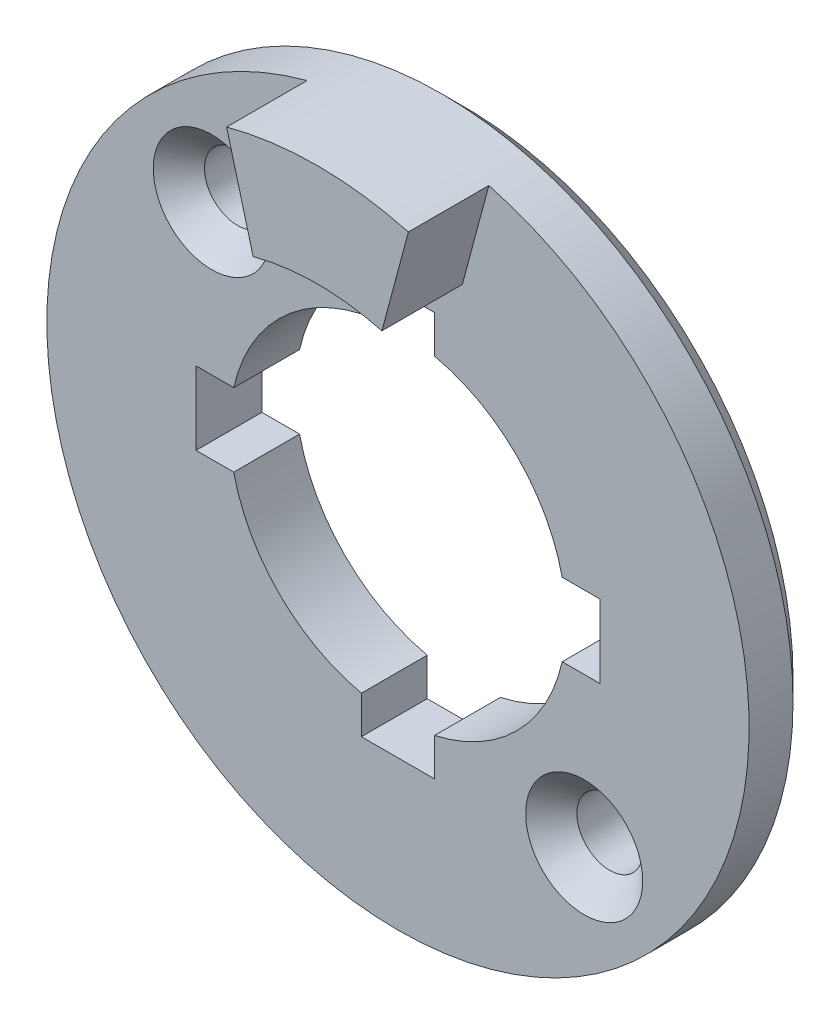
ISO-10303-21;
HEADER;
FILE_DESCRIPTION(('STEP AP214'),'2;1');
FILE_NAME('part.step','',(''),(''),'','','');
FILE_SCHEMA(('AUTOMOTIVE_DESIGN { 1 0 10303 214 1 1 1 1 }'));
ENDSEC;
DATA;
#1=APPLICATION_CONTEXT('core data for automotive mechanical design processes');
#2=APPLICATION_PROTOCOL_DEFINITION('international standard','automotive_design',2000,#1);
#3=PRODUCT_CONTEXT('',#1,'mechanical');
#4=PRODUCT('Part','Part','',(#3));
#5=PRODUCT_RELATED_PRODUCT_CATEGORY('part','',(#4));
#6=PRODUCT_DEFINITION_FORMATION('','',#4);
#7=PRODUCT_DEFINITION_CONTEXT('part definition',#1,'design');
#8=PRODUCT_DEFINITION('design','',#6,#7);
#9=PRODUCT_DEFINITION_SHAPE('','',#8);
#10=(LENGTH_UNIT() NAMED_UNIT(*) SI_UNIT(.MILLI.,.METRE.));
#11=(NAMED_UNIT(*) PLANE_ANGLE_UNIT() SI_UNIT($,.RADIAN.));
#12=(NAMED_UNIT(*) SI_UNIT($,.STERADIAN.) SOLID_ANGLE_UNIT());
#13=UNCERTAINTY_MEASURE_WITH_UNIT(LENGTH_MEASURE(1.E-05),#10,'distance_accuracy_value','');
#14=(GEOMETRIC_REPRESENTATION_CONTEXT(3) GLOBAL_UNCERTAINTY_ASSIGNED_CONTEXT((#13)) GLOBAL_UNIT_ASSIGNED_CONTEXT((#10,
#11,#12)) REPRESENTATION_CONTEXT('',''));
#15=CARTESIAN_POINT('',(0.,0.,0.));
#16=DIRECTION('',(0.,0.,1.));
#17=DIRECTION('',(1.,0.,0.));
#18=AXIS2_PLACEMENT_3D('',#15,#16,#17);
#19=CARTESIAN_POINT('',(0.,0.,4.5));
#20=DIRECTION('',(0.,0.,-1.));
#21=DIRECTION('',(-1.,0.,0.));
#22=AXIS2_PLACEMENT_3D('',#19,#20,#21);
#23=CYLINDRICAL_SURFACE('',#22,11.5);
#24=DIRECTION('',(0.,0.,-1.));
#25=VECTOR('',#24,1.);
#26=CARTESIAN_POINT('',(-11.2249721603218,2.50000000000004,10.000025));
#27=LINE('',#26,#25);
#28=CARTESIAN_POINT('',(-11.2249721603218,2.50000000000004,4.5));
#29=VERTEX_POINT('',#28);
#30=CARTESIAN_POINT('',(-11.2249721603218,2.50000000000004,0.));
#31=VERTEX_POINT('',#30);
#32=EDGE_CURVE('E198',#29,#31,#27,.T.);
#33=ORIENTED_EDGE('',*,*,#32,.T.);
#34=CARTESIAN_POINT('',(0.,0.,0.));
#35=DIRECTION('',(0.,0.,1.));
#36=DIRECTION('',(1.,0.,0.));
#37=AXIS2_PLACEMENT_3D('',#34,#35,#36);
#38=CIRCLE('',#37,11.5);
#39=CARTESIAN_POINT('',(-2.5,11.2249721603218,0.));
#40=VERTEX_POINT('',#39);
#41=EDGE_CURVE('E324',#40,#31,#38,.T.);
#42=ORIENTED_EDGE('',*,*,#41,.F.);
#43=DIRECTION('',(0.,0.,-1.));
#44=VECTOR('',#43,1.);
#45=CARTESIAN_POINT('',(-2.49999999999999,11.2249721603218,4.5));
#46=LINE('',#45,#44);
#47=CARTESIAN_POINT('',(-2.5,11.2249721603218,4.5));
#48=VERTEX_POINT('',#47);
#49=EDGE_CURVE('E303',#48,#40,#46,.T.);
#50=ORIENTED_EDGE('',*,*,#49,.F.);
#51=CARTESIAN_POINT('',(0.,0.,4.5));
#52=DIRECTION('',(0.,0.,1.));
#53=DIRECTION('',(1.,0.,0.));
#54=AXIS2_PLACEMENT_3D('',#51,#52,#53);
#55=CIRCLE('',#54,11.5);
#56=EDGE_CURVE('E335',#48,#29,#55,.T.);
#57=ORIENTED_EDGE('',*,*,#56,.T.);
#58=EDGE_LOOP('',(#33,#42,#50,#57));
#59=FACE_BOUND('',#58,.T.);
#60=ADVANCED_FACE('F36',(#59),#23,.F.);
#61=DIRECTION('',(0.,0.,-1.));
#62=VECTOR('',#61,1.);
#63=CARTESIAN_POINT('',(11.2249721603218,-2.50000000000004,4.5));
#64=LINE('',#63,#62);
#65=CARTESIAN_POINT('',(11.2249721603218,-2.50000000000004,0.));
#66=VERTEX_POINT('',#65);
#67=CARTESIAN_POINT('',(11.2249721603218,-2.50000000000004,4.5));
#68=VERTEX_POINT('',#67);
#69=EDGE_CURVE('E11',#66,#68,#64,.F.);
#70=ORIENTED_EDGE('',*,*,#69,.F.);
#71=CARTESIAN_POINT('',(2.5,-11.2249721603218,0.));
#72=VERTEX_POINT('',#71);
#73=EDGE_CURVE('E320',#72,#66,#38,.T.);
#74=ORIENTED_EDGE('',*,*,#73,.F.);
#75=DIRECTION('',(0.,0.,-1.));
#76=VECTOR('',#75,1.);
#77=CARTESIAN_POINT('',(2.5,-11.2249721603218,4.5));
#78=LINE('',#77,#76);
#79=CARTESIAN_POINT('',(2.5,-11.2249721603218,4.5));
#80=VERTEX_POINT('',#79);
#81=EDGE_CURVE('E305',#80,#72,#78,.T.);
#82=ORIENTED_EDGE('',*,*,#81,.F.);
#83=EDGE_CURVE('E332',#80,#68,#55,.T.);
#84=ORIENTED_EDGE('',*,*,#83,.T.);
#85=EDGE_LOOP('',(#70,#74,#82,#84));
#86=FACE_BOUND('',#85,.T.);
#87=ADVANCED_FACE('F382',(#86),#23,.F.);
#88=DIRECTION('',(0.,0.,-1.));
#89=VECTOR('',#88,1.);
#90=CARTESIAN_POINT('',(-11.2249721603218,-2.49999999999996,10.000025));
#91=LINE('',#90,#89);
#92=CARTESIAN_POINT('',(-11.2249721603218,-2.49999999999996,4.5));
#93=VERTEX_POINT('',#92);
#94=CARTESIAN_POINT('',(-11.2249721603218,-2.49999999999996,0.));
#95=VERTEX_POINT('',#94);
#96=EDGE_CURVE('E51',#93,#95,#91,.T.);
#97=ORIENTED_EDGE('',*,*,#96,.F.);
#98=CARTESIAN_POINT('',(-2.5,-11.2249721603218,4.5));
#99=VERTEX_POINT('',#98);
#100=EDGE_CURVE('E333',#93,#99,#55,.T.);
#101=ORIENTED_EDGE('',*,*,#100,.T.);
#102=DIRECTION('',(0.,0.,-1.));
#103=VECTOR('',#102,1.);
#104=CARTESIAN_POINT('',(-2.5,-11.2249721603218,4.5));
#105=LINE('',#104,#103);
#106=CARTESIAN_POINT('',(-2.5,-11.2249721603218,0.));
#107=VERTEX_POINT('',#106);
#108=EDGE_CURVE('E307',#107,#99,#105,.F.);
#109=ORIENTED_EDGE('',*,*,#108,.F.);
#110=EDGE_CURVE('E322',#95,#107,#38,.T.);
#111=ORIENTED_EDGE('',*,*,#110,.F.);
#112=EDGE_LOOP('',(#97,#101,#109,#111));
#113=FACE_BOUND('',#112,.T.);
#114=ADVANCED_FACE('F387',(#113),#23,.F.);
#115=CARTESIAN_POINT('',(0.,0.,4.5));
#116=DIRECTION('',(0.,0.,1.));
#117=DIRECTION('',(1.,0.,0.));
#118=AXIS2_PLACEMENT_3D('',#115,#116,#117);
#119=PLANE('',#118);
#120=CARTESIAN_POINT('',(-12.727922,12.727922,4.5));
#121=DIRECTION('',(0.,0.,1.));
#122=DIRECTION('',(1.,0.,0.));
#123=AXIS2_PLACEMENT_3D('',#120,#121,#122);
#124=CIRCLE('',#123,4.);
#125=CARTESIAN_POINT('',(-8.727922,12.727922,4.5));
#126=VERTEX_POINT('',#125);
#127=EDGE_CURVE('E496',#126,#126,#124,.T.);
#128=ORIENTED_EDGE('',*,*,#127,.F.);
#129=EDGE_LOOP('',(#128));
#130=FACE_BOUND('',#129,.T.);
#131=CARTESIAN_POINT('',(12.727922,-12.7279219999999,4.5));
#132=DIRECTION('',(0.,0.,1.));
#133=DIRECTION('',(1.,0.,0.));
#134=AXIS2_PLACEMENT_3D('',#131,#132,#133);
#135=CIRCLE('',#134,4.);
#136=CARTESIAN_POINT('',(16.727922,-12.7279219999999,4.5));
#137=VERTEX_POINT('',#136);
#138=EDGE_CURVE('E189',#137,#137,#135,.T.);
#139=ORIENTED_EDGE('',*,*,#138,.F.);
#140=EDGE_LOOP('',(#139));
#141=FACE_BOUND('',#140,.T.);
#142=DIRECTION('',(-1.,0.,0.));
#143=VECTOR('',#142,1.);
#144=CARTESIAN_POINT('',(0.,2.5,4.5));
#145=LINE('',#144,#143);
#146=CARTESIAN_POINT('',(-13.8,2.50000000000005,4.5));
#147=VERTEX_POINT('',#146);
#148=EDGE_CURVE('E206',#29,#147,#145,.T.);
#149=ORIENTED_EDGE('',*,*,#148,.F.);
#150=ORIENTED_EDGE('',*,*,#56,.F.);
#151=DIRECTION('',(0.,-1.,0.));
#152=VECTOR('',#151,1.);
#153=CARTESIAN_POINT('',(-2.5,0.,4.5));
#154=LINE('',#153,#152);
#155=CARTESIAN_POINT('',(-2.5,13.8,4.5));
#156=VERTEX_POINT('',#155);
#157=EDGE_CURVE('E256',#156,#48,#154,.T.);
#158=ORIENTED_EDGE('',*,*,#157,.F.);
#159=DIRECTION('',(-1.,0.,0.));
#160=VECTOR('',#159,1.);
#161=CARTESIAN_POINT('',(0.,13.8,4.5));
#162=LINE('',#161,#160);
#163=CARTESIAN_POINT('',(2.5,13.8,4.5));
#164=VERTEX_POINT('',#163);
#165=EDGE_CURVE('E261',#164,#156,#162,.T.);
#166=ORIENTED_EDGE('',*,*,#165,.F.);
#167=DIRECTION('',(0.,1.,0.));
#168=VECTOR('',#167,1.);
#169=CARTESIAN_POINT('',(2.5,0.,4.5));
#170=LINE('',#169,#168);
#171=CARTESIAN_POINT('',(2.5,11.2249721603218,4.5));
#172=VERTEX_POINT('',#171);
#173=EDGE_CURVE('E259',#172,#164,#170,.T.);
#174=ORIENTED_EDGE('',*,*,#173,.F.);
#175=CARTESIAN_POINT('',(11.2249721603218,2.49999999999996,4.5));
#176=VERTEX_POINT('',#175);
#177=EDGE_CURVE('E329',#176,#172,#55,.T.);
#178=ORIENTED_EDGE('',*,*,#177,.F.);
#179=DIRECTION('',(-1.,0.,0.));
#180=VECTOR('',#179,1.);
#181=CARTESIAN_POINT('',(0.,2.5,4.5));
#182=LINE('',#181,#180);
#183=CARTESIAN_POINT('',(13.8,2.49999999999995,4.5));
#184=VERTEX_POINT('',#183);
#185=EDGE_CURVE('E59',#184,#176,#182,.T.);
#186=ORIENTED_EDGE('',*,*,#185,.F.);
#187=DIRECTION('',(0.,1.,0.));
#188=VECTOR('',#187,1.);
#189=CARTESIAN_POINT('',(13.8,0.,4.5));
#190=LINE('',#189,#188);
#191=CARTESIAN_POINT('',(13.8,-2.50000000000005,4.5));
#192=VERTEX_POINT('',#191);
#193=EDGE_CURVE('E223',#192,#184,#190,.T.);
#194=ORIENTED_EDGE('',*,*,#193,.F.);
#195=DIRECTION('',(1.,0.,0.));
#196=VECTOR('',#195,1.);
#197=CARTESIAN_POINT('',(0.,-2.5,4.5));
#198=LINE('',#197,#196);
#199=EDGE_CURVE('E221',#68,#192,#198,.T.);
#200=ORIENTED_EDGE('',*,*,#199,.F.);
#201=ORIENTED_EDGE('',*,*,#83,.F.);
#202=DIRECTION('',(0.,1.,0.));
#203=VECTOR('',#202,1.);
#204=CARTESIAN_POINT('',(2.5,0.,4.5));
#205=LINE('',#204,#203);
#206=CARTESIAN_POINT('',(2.5,-13.8,4.5));
#207=VERTEX_POINT('',#206);
#208=EDGE_CURVE('E237',#207,#80,#205,.T.);
#209=ORIENTED_EDGE('',*,*,#208,.F.);
#210=DIRECTION('',(1.,0.,0.));
#211=VECTOR('',#210,1.);
#212=CARTESIAN_POINT('',(0.,-13.8,4.5));
#213=LINE('',#212,#211);
#214=CARTESIAN_POINT('',(-2.5,-13.8,4.5));
#215=VERTEX_POINT('',#214);
#216=EDGE_CURVE('E242',#215,#207,#213,.T.);
#217=ORIENTED_EDGE('',*,*,#216,.F.);
#218=DIRECTION('',(0.,-1.,0.));
#219=VECTOR('',#218,1.);
#220=CARTESIAN_POINT('',(-2.5,0.,4.5));
#221=LINE('',#220,#219);
#222=EDGE_CURVE('E240',#99,#215,#221,.T.);
#223=ORIENTED_EDGE('',*,*,#222,.F.);
#224=ORIENTED_EDGE('',*,*,#100,.F.);
#225=DIRECTION('',(1.,0.,0.));
#226=VECTOR('',#225,1.);
#227=CARTESIAN_POINT('',(0.,-2.5,4.5));
#228=LINE('',#227,#226);
#229=CARTESIAN_POINT('',(-13.8,-2.49999999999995,4.5));
#230=VERTEX_POINT('',#229);
#231=EDGE_CURVE('E201',#230,#93,#228,.T.);
#232=ORIENTED_EDGE('',*,*,#231,.F.);
#233=DIRECTION('',(0.,-1.,0.));
#234=VECTOR('',#233,1.);
#235=CARTESIAN_POINT('',(-13.8,0.,4.5));
#236=LINE('',#235,#234);
#237=EDGE_CURVE('E181',#147,#230,#236,.T.);
#238=ORIENTED_EDGE('',*,*,#237,.F.);
#239=EDGE_LOOP('',(#149,#150,#158,#166,#174,#178,#186,#194,#200,#201,#209,#217,#223,#224,#232,#238));
#240=FACE_BOUND('',#239,.T.);
#241=DIRECTION('',(0.258819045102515,-0.96592582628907,0.));
#242=VECTOR('',#241,1.);
#243=CARTESIAN_POINT('',(-6.21165708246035,23.1822198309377,4.5));
#244=LINE('',#243,#242);
#245=CARTESIAN_POINT('',(-6.21165708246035,23.1822198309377,4.5));
#246=VERTEX_POINT('',#245);
#247=CARTESIAN_POINT('',(-4.39992376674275,16.4207390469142,4.5));
#248=VERTEX_POINT('',#247);
#249=EDGE_CURVE('E275',#246,#248,#244,.T.);
#250=ORIENTED_EDGE('',*,*,#249,.F.);
#251=CARTESIAN_POINT('',(0.,0.,4.5));
#252=DIRECTION('',(0.,0.,1.));
#253=DIRECTION('',(1.,0.,0.));
#254=AXIS2_PLACEMENT_3D('',#251,#252,#253);
#255=CIRCLE('',#254,24.);
#256=CARTESIAN_POINT('',(6.21165708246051,23.1822198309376,4.5));
#257=VERTEX_POINT('',#256);
#258=EDGE_CURVE('E276',#246,#257,#255,.T.);
#259=ORIENTED_EDGE('',*,*,#258,.T.);
#260=DIRECTION('',(0.258819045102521,0.965925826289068,0.));
#261=VECTOR('',#260,1.);
#262=CARTESIAN_POINT('',(4.39992376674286,16.4207390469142,4.5));
#263=LINE('',#262,#261);
#264=CARTESIAN_POINT('',(4.39992376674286,16.4207390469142,4.5));
#265=VERTEX_POINT('',#264);
#266=EDGE_CURVE('E266',#265,#257,#263,.T.);
#267=ORIENTED_EDGE('',*,*,#266,.F.);
#268=CARTESIAN_POINT('',(0.,0.,4.5));
#269=DIRECTION('',(0.,0.,-1.));
#270=DIRECTION('',(1.,0.,0.));
#271=AXIS2_PLACEMENT_3D('',#268,#269,#270);
#272=CIRCLE('',#271,17.);
#273=EDGE_CURVE('E263',#248,#265,#272,.T.);
#274=ORIENTED_EDGE('',*,*,#273,.F.);
#275=EDGE_LOOP('',(#250,#259,#267,#274));
#276=FACE_BOUND('',#275,.T.);
#277=ADVANCED_FACE('F345',(#130,#141,#240,#276),#119,.T.);
#278=CARTESIAN_POINT('',(0.,0.,0.));
#279=DIRECTION('',(0.,0.,1.));
#280=DIRECTION('',(1.,0.,0.));
#281=AXIS2_PLACEMENT_3D('',#278,#279,#280);
#282=PLANE('',#281);
#283=CARTESIAN_POINT('',(-12.727922,12.727922,0.));
#284=DIRECTION('',(0.,0.,1.));
#285=DIRECTION('',(1.,0.,0.));
#286=AXIS2_PLACEMENT_3D('',#283,#284,#285);
#287=CIRCLE('',#286,2.24999999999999);
#288=CARTESIAN_POINT('',(-10.477922,12.727922,0.));
#289=VERTEX_POINT('',#288);
#290=EDGE_CURVE('E502',#289,#289,#287,.T.);
#291=ORIENTED_EDGE('',*,*,#290,.T.);
#292=EDGE_LOOP('',(#291));
#293=FACE_BOUND('',#292,.T.);
#294=CARTESIAN_POINT('',(12.727922,-12.7279219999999,0.));
#295=DIRECTION('',(0.,0.,1.));
#296=DIRECTION('',(1.,0.,0.));
#297=AXIS2_PLACEMENT_3D('',#294,#295,#296);
#298=CIRCLE('',#297,2.24999999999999);
#299=CARTESIAN_POINT('',(14.977922,-12.7279219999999,0.));
#300=VERTEX_POINT('',#299);
#301=EDGE_CURVE('E491',#300,#300,#298,.T.);
#302=ORIENTED_EDGE('',*,*,#301,.T.);
#303=EDGE_LOOP('',(#302));
#304=FACE_BOUND('',#303,.T.);
#305=CARTESIAN_POINT('',(0.,0.,0.));
#306=DIRECTION('',(0.,0.,1.));
#307=DIRECTION('',(1.,0.,0.));
#308=AXIS2_PLACEMENT_3D('',#305,#306,#307);
#309=CIRCLE('',#308,22.5);
#310=CARTESIAN_POINT('',(22.5,0.,0.));
#311=VERTEX_POINT('',#310);
#312=EDGE_CURVE('E297',#311,#311,#309,.F.);
#313=ORIENTED_EDGE('',*,*,#312,.T.);
#314=EDGE_LOOP('',(#313));
#315=FACE_BOUND('',#314,.T.);
#316=ORIENTED_EDGE('',*,*,#41,.T.);
#317=DIRECTION('',(1.,0.,0.));
#318=VECTOR('',#317,1.);
#319=CARTESIAN_POINT('',(-11.2249721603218,2.50000000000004,0.));
#320=LINE('',#319,#318);
#321=CARTESIAN_POINT('',(-13.8,2.50000000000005,0.));
#322=VERTEX_POINT('',#321);
#323=EDGE_CURVE('E193',#322,#31,#320,.T.);
#324=ORIENTED_EDGE('',*,*,#323,.F.);
#325=DIRECTION('',(0.,1.,0.));
#326=VECTOR('',#325,1.);
#327=CARTESIAN_POINT('',(-13.8,-2.49999999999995,0.));
#328=LINE('',#327,#326);
#329=CARTESIAN_POINT('',(-13.8,-2.49999999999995,0.));
#330=VERTEX_POINT('',#329);
#331=EDGE_CURVE('E178',#330,#322,#328,.T.);
#332=ORIENTED_EDGE('',*,*,#331,.F.);
#333=DIRECTION('',(-1.,0.,0.));
#334=VECTOR('',#333,1.);
#335=CARTESIAN_POINT('',(-11.2249721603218,-2.49999999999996,0.));
#336=LINE('',#335,#334);
#337=EDGE_CURVE('E185',#95,#330,#336,.T.);
#338=ORIENTED_EDGE('',*,*,#337,.F.);
#339=ORIENTED_EDGE('',*,*,#110,.T.);
#340=DIRECTION('',(0.,1.,0.));
#341=VECTOR('',#340,1.);
#342=CARTESIAN_POINT('',(-2.5,-11.2249721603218,0.));
#343=LINE('',#342,#341);
#344=CARTESIAN_POINT('',(-2.5,-13.8,0.));
#345=VERTEX_POINT('',#344);
#346=EDGE_CURVE('E231',#345,#107,#343,.T.);
#347=ORIENTED_EDGE('',*,*,#346,.F.);
#348=DIRECTION('',(-1.,0.,0.));
#349=VECTOR('',#348,1.);
#350=CARTESIAN_POINT('',(2.5,-13.8,0.));
#351=LINE('',#350,#349);
#352=CARTESIAN_POINT('',(2.5,-13.8,0.));
#353=VERTEX_POINT('',#352);
#354=EDGE_CURVE('E228',#353,#345,#351,.T.);
#355=ORIENTED_EDGE('',*,*,#354,.F.);
#356=DIRECTION('',(0.,-1.,0.));
#357=VECTOR('',#356,1.);
#358=CARTESIAN_POINT('',(2.5,-11.2249721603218,0.));
#359=LINE('',#358,#357);
#360=EDGE_CURVE('E225',#72,#353,#359,.T.);
#361=ORIENTED_EDGE('',*,*,#360,.F.);
#362=ORIENTED_EDGE('',*,*,#73,.T.);
#363=DIRECTION('',(-1.,0.,0.));
#364=VECTOR('',#363,1.);
#365=CARTESIAN_POINT('',(11.2249721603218,-2.50000000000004,0.));
#366=LINE('',#365,#364);
#367=CARTESIAN_POINT('',(13.8,-2.50000000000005,0.));
#368=VERTEX_POINT('',#367);
#369=EDGE_CURVE('E214',#368,#66,#366,.T.);
#370=ORIENTED_EDGE('',*,*,#369,.F.);
#371=DIRECTION('',(0.,-1.,0.));
#372=VECTOR('',#371,1.);
#373=CARTESIAN_POINT('',(13.8,-2.50000000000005,0.));
#374=LINE('',#373,#372);
#375=CARTESIAN_POINT('',(13.8,2.49999999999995,0.));
#376=VERTEX_POINT('',#375);
#377=EDGE_CURVE('E211',#376,#368,#374,.T.);
#378=ORIENTED_EDGE('',*,*,#377,.F.);
#379=DIRECTION('',(1.,0.,0.));
#380=VECTOR('',#379,1.);
#381=CARTESIAN_POINT('',(11.2249721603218,2.49999999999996,0.));
#382=LINE('',#381,#380);
#383=CARTESIAN_POINT('',(11.2249721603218,2.49999999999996,0.));
#384=VERTEX_POINT('',#383);
#385=EDGE_CURVE('E208',#384,#376,#382,.T.);
#386=ORIENTED_EDGE('',*,*,#385,.F.);
#387=CARTESIAN_POINT('',(2.49999999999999,11.2249721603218,0.));
#388=VERTEX_POINT('',#387);
#389=EDGE_CURVE('E316',#384,#388,#38,.T.);
#390=ORIENTED_EDGE('',*,*,#389,.T.);
#391=DIRECTION('',(0.,-1.,0.));
#392=VECTOR('',#391,1.);
#393=CARTESIAN_POINT('',(2.5,11.2249721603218,0.));
#394=LINE('',#393,#392);
#395=CARTESIAN_POINT('',(2.5,13.8,0.));
#396=VERTEX_POINT('',#395);
#397=EDGE_CURVE('E244',#396,#388,#394,.T.);
#398=ORIENTED_EDGE('',*,*,#397,.F.);
#399=DIRECTION('',(1.,0.,0.));
#400=VECTOR('',#399,1.);
#401=CARTESIAN_POINT('',(2.5,13.8,0.));
#402=LINE('',#401,#400);
#403=CARTESIAN_POINT('',(-2.5,13.8,0.));
#404=VERTEX_POINT('',#403);
#405=EDGE_CURVE('E250',#404,#396,#402,.T.);
#406=ORIENTED_EDGE('',*,*,#405,.F.);
#407=DIRECTION('',(0.,1.,0.));
#408=VECTOR('',#407,1.);
#409=CARTESIAN_POINT('',(-2.5,11.2249721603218,0.));
#410=LINE('',#409,#408);
#411=EDGE_CURVE('E247',#40,#404,#410,.T.);
#412=ORIENTED_EDGE('',*,*,#411,.F.);
#413=EDGE_LOOP('',(#316,#324,#332,#338,#339,#347,#355,#361,#362,#370,#378,#386,#390,#398,#406,#412));
#414=FACE_BOUND('',#413,.T.);
#415=ADVANCED_FACE('F192',(#293,#304,#315,#414),#282,.F.);
#416=CARTESIAN_POINT('',(0.,0.,4.5));
#417=DIRECTION('',(0.,0.,-1.));
#418=DIRECTION('',(-1.,0.,0.));
#419=AXIS2_PLACEMENT_3D('',#416,#417,#418);
#420=CYLINDRICAL_SURFACE('',#419,24.);
#421=CARTESIAN_POINT('',(0.,0.,1.5));
#422=DIRECTION('',(0.,0.,1.));
#423=DIRECTION('',(1.,0.,0.));
#424=AXIS2_PLACEMENT_3D('',#421,#422,#423);
#425=CIRCLE('',#424,24.);
#426=CARTESIAN_POINT('',(24.,0.,1.5));
#427=VERTEX_POINT('',#426);
#428=EDGE_CURVE('E294',#427,#427,#425,.T.);
#429=ORIENTED_EDGE('',*,*,#428,.T.);
#430=EDGE_LOOP('',(#429));
#431=FACE_BOUND('',#430,.T.);
#432=ORIENTED_EDGE('',*,*,#258,.F.);
#433=DIRECTION('',(0.,0.,-1.));
#434=VECTOR('',#433,1.);
#435=CARTESIAN_POINT('',(-6.21165708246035,23.1822198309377,10.));
#436=LINE('',#435,#434);
#437=CARTESIAN_POINT('',(-6.21165708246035,23.1822198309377,10.));
#438=VERTEX_POINT('',#437);
#439=EDGE_CURVE('E282',#438,#246,#436,.T.);
#440=ORIENTED_EDGE('',*,*,#439,.F.);
#441=CARTESIAN_POINT('',(0.,0.,10.));
#442=DIRECTION('',(0.,0.,1.));
#443=DIRECTION('',(1.,0.,0.));
#444=AXIS2_PLACEMENT_3D('',#441,#442,#443);
#445=CIRCLE('',#444,24.);
#446=CARTESIAN_POINT('',(6.21165708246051,23.1822198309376,10.));
#447=VERTEX_POINT('',#446);
#448=EDGE_CURVE('E353',#447,#438,#445,.T.);
#449=ORIENTED_EDGE('',*,*,#448,.F.);
#450=DIRECTION('',(0.,0.,-1.));
#451=VECTOR('',#450,1.);
#452=CARTESIAN_POINT('',(6.21165708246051,23.1822198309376,10.));
#453=LINE('',#452,#451);
#454=EDGE_CURVE('E278',#447,#257,#453,.T.);
#455=ORIENTED_EDGE('',*,*,#454,.T.);
#456=EDGE_LOOP('',(#432,#440,#449,#455));
#457=FACE_BOUND('',#456,.T.);
#458=ADVANCED_FACE('F38',(#431,#457),#420,.T.);
#459=DIRECTION('',(0.,0.,-1.));
#460=VECTOR('',#459,1.);
#461=CARTESIAN_POINT('',(11.2249721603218,2.49999999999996,4.5));
#462=LINE('',#461,#460);
#463=EDGE_CURVE('E44',#176,#384,#462,.T.);
#464=ORIENTED_EDGE('',*,*,#463,.F.);
#465=ORIENTED_EDGE('',*,*,#177,.T.);
#466=DIRECTION('',(0.,0.,-1.));
#467=VECTOR('',#466,1.);
#468=CARTESIAN_POINT('',(2.49999999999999,11.2249721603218,4.5));
#469=LINE('',#468,#467);
#470=EDGE_CURVE('E300',#388,#172,#469,.F.);
#471=ORIENTED_EDGE('',*,*,#470,.F.);
#472=ORIENTED_EDGE('',*,*,#389,.F.);
#473=EDGE_LOOP('',(#464,#465,#471,#472));
#474=FACE_BOUND('',#473,.T.);
#475=ADVANCED_FACE('F319',(#474),#23,.F.);
#476=CARTESIAN_POINT('',(0.,0.,10.));
#477=DIRECTION('',(0.,0.,-1.));
#478=DIRECTION('',(-1.,0.,0.));
#479=AXIS2_PLACEMENT_3D('',#476,#477,#478);
#480=CYLINDRICAL_SURFACE('',#479,17.);
#481=ORIENTED_EDGE('',*,*,#273,.T.);
#482=DIRECTION('',(0.,0.,-1.));
#483=VECTOR('',#482,1.);
#484=CARTESIAN_POINT('',(4.39992376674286,16.4207390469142,10.));
#485=LINE('',#484,#483);
#486=CARTESIAN_POINT('',(4.39992376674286,16.4207390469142,10.));
#487=VERTEX_POINT('',#486);
#488=EDGE_CURVE('E281',#487,#265,#485,.T.);
#489=ORIENTED_EDGE('',*,*,#488,.F.);
#490=CARTESIAN_POINT('',(0.,0.,10.));
#491=DIRECTION('',(0.,0.,-1.));
#492=DIRECTION('',(1.,0.,0.));
#493=AXIS2_PLACEMENT_3D('',#490,#491,#492);
#494=CIRCLE('',#493,17.);
#495=CARTESIAN_POINT('',(-4.39992376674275,16.4207390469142,10.));
#496=VERTEX_POINT('',#495);
#497=EDGE_CURVE('E269',#496,#487,#494,.T.);
#498=ORIENTED_EDGE('',*,*,#497,.F.);
#499=DIRECTION('',(0.,0.,-1.));
#500=VECTOR('',#499,1.);
#501=CARTESIAN_POINT('',(-4.39992376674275,16.4207390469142,10.));
#502=LINE('',#501,#500);
#503=EDGE_CURVE('E291',#496,#248,#502,.T.);
#504=ORIENTED_EDGE('',*,*,#503,.T.);
#505=EDGE_LOOP('',(#481,#489,#498,#504));
#506=FACE_BOUND('',#505,.T.);
#507=ADVANCED_FACE('F365',(#506),#480,.F.);
#508=CARTESIAN_POINT('',(4.39992376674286,16.4207390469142,10.));
#509=DIRECTION('',(-0.965925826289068,0.258819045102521,0.));
#510=DIRECTION('',(-0.258819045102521,-0.965925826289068,0.));
#511=AXIS2_PLACEMENT_3D('',#508,#509,#510);
#512=PLANE('',#511);
#513=ORIENTED_EDGE('',*,*,#266,.T.);
#514=ORIENTED_EDGE('',*,*,#454,.F.);
#515=DIRECTION('',(0.258819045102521,0.965925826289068,0.));
#516=VECTOR('',#515,1.);
#517=CARTESIAN_POINT('',(4.39992376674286,16.4207390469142,10.));
#518=LINE('',#517,#516);
#519=EDGE_CURVE('E357',#487,#447,#518,.T.);
#520=ORIENTED_EDGE('',*,*,#519,.F.);
#521=ORIENTED_EDGE('',*,*,#488,.T.);
#522=EDGE_LOOP('',(#513,#514,#520,#521));
#523=FACE_BOUND('',#522,.T.);
#524=ADVANCED_FACE('F350',(#523),#512,.F.);
#525=CARTESIAN_POINT('',(-6.21165708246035,23.1822198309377,10.));
#526=DIRECTION('',(0.96592582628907,0.258819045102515,0.));
#527=DIRECTION('',(-0.258819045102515,0.96592582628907,0.));
#528=AXIS2_PLACEMENT_3D('',#525,#526,#527);
#529=PLANE('',#528);
#530=ORIENTED_EDGE('',*,*,#249,.T.);
#531=ORIENTED_EDGE('',*,*,#503,.F.);
#532=DIRECTION('',(0.258819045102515,-0.96592582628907,0.));
#533=VECTOR('',#532,1.);
#534=CARTESIAN_POINT('',(-6.21165708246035,23.1822198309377,10.));
#535=LINE('',#534,#533);
#536=EDGE_CURVE('E356',#438,#496,#535,.T.);
#537=ORIENTED_EDGE('',*,*,#536,.F.);
#538=ORIENTED_EDGE('',*,*,#439,.T.);
#539=EDGE_LOOP('',(#530,#531,#537,#538));
#540=FACE_BOUND('',#539,.T.);
#541=ADVANCED_FACE('F368',(#540),#529,.F.);
#542=CARTESIAN_POINT('',(0.,0.,10.));
#543=DIRECTION('',(0.,0.,1.));
#544=DIRECTION('',(1.,0.,0.));
#545=AXIS2_PLACEMENT_3D('',#542,#543,#544);
#546=PLANE('',#545);
#547=ORIENTED_EDGE('',*,*,#497,.T.);
#548=ORIENTED_EDGE('',*,*,#519,.T.);
#549=ORIENTED_EDGE('',*,*,#448,.T.);
#550=ORIENTED_EDGE('',*,*,#536,.T.);
#551=EDGE_LOOP('',(#547,#548,#549,#550));
#552=FACE_BOUND('',#551,.T.);
#553=ADVANCED_FACE('F369',(#552),#546,.T.);
#554=CARTESIAN_POINT('',(0.,0.,1.5));
#555=DIRECTION('',(0.,0.,1.));
#556=DIRECTION('',(1.,0.,0.));
#557=AXIS2_PLACEMENT_3D('',#554,#555,#556);
#558=CONICAL_SURFACE('',#557,24.,0.78539816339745);
#559=ORIENTED_EDGE('',*,*,#312,.F.);
#560=EDGE_LOOP('',(#559));
#561=FACE_BOUND('',#560,.T.);
#562=ORIENTED_EDGE('',*,*,#428,.F.);
#563=EDGE_LOOP('',(#562));
#564=FACE_BOUND('',#563,.T.);
#565=ADVANCED_FACE('F371',(#561,#564),#558,.T.);
#566=CARTESIAN_POINT('',(2.5,11.2249721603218,10.000025));
#567=DIRECTION('',(1.,0.,0.));
#568=DIRECTION('',(0.,1.,0.));
#569=AXIS2_PLACEMENT_3D('',#566,#567,#568);
#570=PLANE('',#569);
#571=ORIENTED_EDGE('',*,*,#173,.T.);
#572=DIRECTION('',(0.,0.,-1.));
#573=VECTOR('',#572,1.);
#574=CARTESIAN_POINT('',(2.5,13.8,10.000025));
#575=LINE('',#574,#573);
#576=EDGE_CURVE('E254',#164,#396,#575,.T.);
#577=ORIENTED_EDGE('',*,*,#576,.T.);
#578=ORIENTED_EDGE('',*,*,#397,.T.);
#579=ORIENTED_EDGE('',*,*,#470,.T.);
#580=EDGE_LOOP('',(#571,#577,#578,#579));
#581=FACE_BOUND('',#580,.T.);
#582=ADVANCED_FACE('F377',(#581),#570,.F.);
#583=CARTESIAN_POINT('',(2.5,13.8,10.000025));
#584=DIRECTION('',(0.,1.,0.));
#585=DIRECTION('',(0.,0.,1.));
#586=AXIS2_PLACEMENT_3D('',#583,#584,#585);
#587=PLANE('',#586);
#588=ORIENTED_EDGE('',*,*,#165,.T.);
#589=DIRECTION('',(0.,0.,-1.));
#590=VECTOR('',#589,1.);
#591=CARTESIAN_POINT('',(-2.5,13.8,10.000025));
#592=LINE('',#591,#590);
#593=EDGE_CURVE('E253',#156,#404,#592,.T.);
#594=ORIENTED_EDGE('',*,*,#593,.T.);
#595=ORIENTED_EDGE('',*,*,#405,.T.);
#596=ORIENTED_EDGE('',*,*,#576,.F.);
#597=EDGE_LOOP('',(#588,#594,#595,#596));
#598=FACE_BOUND('',#597,.T.);
#599=ADVANCED_FACE('F446',(#598),#587,.F.);
#600=CARTESIAN_POINT('',(-2.5,11.2249721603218,10.000025));
#601=DIRECTION('',(-1.,0.,0.));
#602=DIRECTION('',(0.,-1.,0.));
#603=AXIS2_PLACEMENT_3D('',#600,#601,#602);
#604=PLANE('',#603);
#605=ORIENTED_EDGE('',*,*,#157,.T.);
#606=ORIENTED_EDGE('',*,*,#49,.T.);
#607=ORIENTED_EDGE('',*,*,#411,.T.);
#608=ORIENTED_EDGE('',*,*,#593,.F.);
#609=EDGE_LOOP('',(#605,#606,#607,#608));
#610=FACE_BOUND('',#609,.T.);
#611=ADVANCED_FACE('F441',(#610),#604,.F.);
#612=CARTESIAN_POINT('',(-2.5,-11.2249721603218,10.000025));
#613=DIRECTION('',(-1.,0.,0.));
#614=DIRECTION('',(0.,-1.,0.));
#615=AXIS2_PLACEMENT_3D('',#612,#613,#614);
#616=PLANE('',#615);
#617=ORIENTED_EDGE('',*,*,#222,.T.);
#618=DIRECTION('',(0.,0.,-1.));
#619=VECTOR('',#618,1.);
#620=CARTESIAN_POINT('',(-2.5,-13.8,10.000025));
#621=LINE('',#620,#619);
#622=EDGE_CURVE('E235',#215,#345,#621,.T.);
#623=ORIENTED_EDGE('',*,*,#622,.T.);
#624=ORIENTED_EDGE('',*,*,#346,.T.);
#625=ORIENTED_EDGE('',*,*,#108,.T.);
#626=EDGE_LOOP('',(#617,#623,#624,#625));
#627=FACE_BOUND('',#626,.T.);
#628=ADVANCED_FACE('F409',(#627),#616,.F.);
#629=CARTESIAN_POINT('',(2.5,-13.8,10.000025));
#630=DIRECTION('',(0.,-1.,0.));
#631=DIRECTION('',(0.,0.,-1.));
#632=AXIS2_PLACEMENT_3D('',#629,#630,#631);
#633=PLANE('',#632);
#634=ORIENTED_EDGE('',*,*,#216,.T.);
#635=DIRECTION('',(0.,0.,-1.));
#636=VECTOR('',#635,1.);
#637=CARTESIAN_POINT('',(2.5,-13.8,10.000025));
#638=LINE('',#637,#636);
#639=EDGE_CURVE('E234',#207,#353,#638,.T.);
#640=ORIENTED_EDGE('',*,*,#639,.T.);
#641=ORIENTED_EDGE('',*,*,#354,.T.);
#642=ORIENTED_EDGE('',*,*,#622,.F.);
#643=EDGE_LOOP('',(#634,#640,#641,#642));
#644=FACE_BOUND('',#643,.T.);
#645=ADVANCED_FACE('F411',(#644),#633,.F.);
#646=CARTESIAN_POINT('',(2.5,-11.2249721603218,10.000025));
#647=DIRECTION('',(1.,0.,0.));
#648=DIRECTION('',(0.,1.,0.));
#649=AXIS2_PLACEMENT_3D('',#646,#647,#648);
#650=PLANE('',#649);
#651=ORIENTED_EDGE('',*,*,#208,.T.);
#652=ORIENTED_EDGE('',*,*,#81,.T.);
#653=ORIENTED_EDGE('',*,*,#360,.T.);
#654=ORIENTED_EDGE('',*,*,#639,.F.);
#655=EDGE_LOOP('',(#651,#652,#653,#654));
#656=FACE_BOUND('',#655,.T.);
#657=ADVANCED_FACE('F435',(#656),#650,.F.);
#658=CARTESIAN_POINT('',(11.2249721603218,-2.50000000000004,10.000025));
#659=DIRECTION('',(0.,-1.,0.));
#660=DIRECTION('',(1.,0.,0.));
#661=AXIS2_PLACEMENT_3D('',#658,#659,#660);
#662=PLANE('',#661);
#663=ORIENTED_EDGE('',*,*,#199,.T.);
#664=DIRECTION('',(0.,0.,-1.));
#665=VECTOR('',#664,1.);
#666=CARTESIAN_POINT('',(13.8,-2.50000000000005,10.000025));
#667=LINE('',#666,#665);
#668=EDGE_CURVE('E217',#192,#368,#667,.T.);
#669=ORIENTED_EDGE('',*,*,#668,.T.);
#670=ORIENTED_EDGE('',*,*,#369,.T.);
#671=ORIENTED_EDGE('',*,*,#69,.T.);
#672=EDGE_LOOP('',(#663,#669,#670,#671));
#673=FACE_BOUND('',#672,.T.);
#674=ADVANCED_FACE('F422',(#673),#662,.F.);
#675=CARTESIAN_POINT('',(13.8,-2.50000000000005,10.000025));
#676=DIRECTION('',(1.,0.,0.));
#677=DIRECTION('',(0.,1.,0.));
#678=AXIS2_PLACEMENT_3D('',#675,#676,#677);
#679=PLANE('',#678);
#680=ORIENTED_EDGE('',*,*,#193,.T.);
#681=DIRECTION('',(0.,0.,-1.));
#682=VECTOR('',#681,1.);
#683=CARTESIAN_POINT('',(13.8,2.49999999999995,10.000025));
#684=LINE('',#683,#682);
#685=EDGE_CURVE('E216',#184,#376,#684,.T.);
#686=ORIENTED_EDGE('',*,*,#685,.T.);
#687=ORIENTED_EDGE('',*,*,#377,.T.);
#688=ORIENTED_EDGE('',*,*,#668,.F.);
#689=EDGE_LOOP('',(#680,#686,#687,#688));
#690=FACE_BOUND('',#689,.T.);
#691=ADVANCED_FACE('F426',(#690),#679,.F.);
#692=CARTESIAN_POINT('',(11.2249721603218,2.49999999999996,10.000025));
#693=DIRECTION('',(0.,1.,0.));
#694=DIRECTION('',(-1.,0.,0.));
#695=AXIS2_PLACEMENT_3D('',#692,#693,#694);
#696=PLANE('',#695);
#697=ORIENTED_EDGE('',*,*,#185,.T.);
#698=ORIENTED_EDGE('',*,*,#463,.T.);
#699=ORIENTED_EDGE('',*,*,#385,.T.);
#700=ORIENTED_EDGE('',*,*,#685,.F.);
#701=EDGE_LOOP('',(#697,#698,#699,#700));
#702=FACE_BOUND('',#701,.T.);
#703=ADVANCED_FACE('F310',(#702),#696,.F.);
#704=CARTESIAN_POINT('',(-11.2249721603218,2.50000000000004,10.000025));
#705=DIRECTION('',(0.,1.,0.));
#706=DIRECTION('',(-1.,0.,0.));
#707=AXIS2_PLACEMENT_3D('',#704,#705,#706);
#708=PLANE('',#707);
#709=ORIENTED_EDGE('',*,*,#148,.T.);
#710=DIRECTION('',(0.,0.,-1.));
#711=VECTOR('',#710,1.);
#712=CARTESIAN_POINT('',(-13.8,2.50000000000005,10.000025));
#713=LINE('',#712,#711);
#714=EDGE_CURVE('E183',#147,#322,#713,.T.);
#715=ORIENTED_EDGE('',*,*,#714,.T.);
#716=ORIENTED_EDGE('',*,*,#323,.T.);
#717=ORIENTED_EDGE('',*,*,#32,.F.);
#718=EDGE_LOOP('',(#709,#715,#716,#717));
#719=FACE_BOUND('',#718,.T.);
#720=ADVANCED_FACE('F433',(#719),#708,.F.);
#721=CARTESIAN_POINT('',(-13.8,-2.49999999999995,10.000025));
#722=DIRECTION('',(-1.,0.,0.));
#723=DIRECTION('',(0.,-1.,0.));
#724=AXIS2_PLACEMENT_3D('',#721,#722,#723);
#725=PLANE('',#724);
#726=ORIENTED_EDGE('',*,*,#237,.T.);
#727=DIRECTION('',(0.,0.,-1.));
#728=VECTOR('',#727,1.);
#729=CARTESIAN_POINT('',(-13.8,-2.49999999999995,10.000025));
#730=LINE('',#729,#728);
#731=EDGE_CURVE('E174',#230,#330,#730,.T.);
#732=ORIENTED_EDGE('',*,*,#731,.T.);
#733=ORIENTED_EDGE('',*,*,#331,.T.);
#734=ORIENTED_EDGE('',*,*,#714,.F.);
#735=EDGE_LOOP('',(#726,#732,#733,#734));
#736=FACE_BOUND('',#735,.T.);
#737=ADVANCED_FACE('F175',(#736),#725,.F.);
#738=CARTESIAN_POINT('',(-11.2249721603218,-2.49999999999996,10.000025));
#739=DIRECTION('',(0.,-1.,0.));
#740=DIRECTION('',(1.,0.,0.));
#741=AXIS2_PLACEMENT_3D('',#738,#739,#740);
#742=PLANE('',#741);
#743=ORIENTED_EDGE('',*,*,#231,.T.);
#744=ORIENTED_EDGE('',*,*,#96,.T.);
#745=ORIENTED_EDGE('',*,*,#337,.T.);
#746=ORIENTED_EDGE('',*,*,#731,.F.);
#747=EDGE_LOOP('',(#743,#744,#745,#746));
#748=FACE_BOUND('',#747,.T.);
#749=ADVANCED_FACE('F186',(#748),#742,.F.);
#750=CARTESIAN_POINT('',(12.727922,-12.7279219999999,4.5));
#751=DIRECTION('',(0.,0.,1.));
#752=DIRECTION('',(1.,0.,0.));
#753=AXIS2_PLACEMENT_3D('',#750,#751,#752);
#754=CONICAL_SURFACE('',#753,4.,0.785398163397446);
#755=CARTESIAN_POINT('',(12.727922,-12.7279219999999,2.74999999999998));
#756=DIRECTION('',(0.,0.,1.));
#757=DIRECTION('',(1.,0.,0.));
#758=AXIS2_PLACEMENT_3D('',#755,#756,#757);
#759=CIRCLE('',#758,2.24999999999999);
#760=CARTESIAN_POINT('',(14.977922,-12.7279219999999,2.74999999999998));
#761=VERTEX_POINT('',#760);
#762=EDGE_CURVE('E487',#761,#761,#759,.T.);
#763=ORIENTED_EDGE('',*,*,#762,.F.);
#764=EDGE_LOOP('',(#763));
#765=FACE_BOUND('',#764,.T.);
#766=ORIENTED_EDGE('',*,*,#138,.T.);
#767=EDGE_LOOP('',(#766));
#768=FACE_BOUND('',#767,.T.);
#769=ADVANCED_FACE('F471',(#765,#768),#754,.F.);
#770=CARTESIAN_POINT('',(12.727922,-12.7279219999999,4.5));
#771=DIRECTION('',(0.,0.,1.));
#772=DIRECTION('',(1.,0.,0.));
#773=AXIS2_PLACEMENT_3D('',#770,#771,#772);
#774=CYLINDRICAL_SURFACE('',#773,2.24999999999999);
#775=ORIENTED_EDGE('',*,*,#301,.F.);
#776=EDGE_LOOP('',(#775));
#777=FACE_BOUND('',#776,.T.);
#778=ORIENTED_EDGE('',*,*,#762,.T.);
#779=EDGE_LOOP('',(#778));
#780=FACE_BOUND('',#779,.T.);
#781=ADVANCED_FACE('F477',(#777,#780),#774,.F.);
#782=CARTESIAN_POINT('',(-12.727922,12.727922,4.5));
#783=DIRECTION('',(0.,0.,1.));
#784=DIRECTION('',(1.,0.,0.));
#785=AXIS2_PLACEMENT_3D('',#782,#783,#784);
#786=CONICAL_SURFACE('',#785,4.,0.785398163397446);
#787=CARTESIAN_POINT('',(-12.727922,12.727922,2.74999999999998));
#788=DIRECTION('',(0.,0.,1.));
#789=DIRECTION('',(1.,0.,0.));
#790=AXIS2_PLACEMENT_3D('',#787,#788,#789);
#791=CIRCLE('',#790,2.24999999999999);
#792=CARTESIAN_POINT('',(-10.477922,12.727922,2.74999999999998));
#793=VERTEX_POINT('',#792);
#794=EDGE_CURVE('E499',#793,#793,#791,.T.);
#795=ORIENTED_EDGE('',*,*,#794,.F.);
#796=EDGE_LOOP('',(#795));
#797=FACE_BOUND('',#796,.T.);
#798=ORIENTED_EDGE('',*,*,#127,.T.);
#799=EDGE_LOOP('',(#798));
#800=FACE_BOUND('',#799,.T.);
#801=ADVANCED_FACE('F482',(#797,#800),#786,.F.);
#802=CARTESIAN_POINT('',(-12.727922,12.727922,4.5));
#803=DIRECTION('',(0.,0.,1.));
#804=DIRECTION('',(1.,0.,0.));
#805=AXIS2_PLACEMENT_3D('',#802,#803,#804);
#806=CYLINDRICAL_SURFACE('',#805,2.24999999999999);
#807=ORIENTED_EDGE('',*,*,#290,.F.);
#808=EDGE_LOOP('',(#807));
#809=FACE_BOUND('',#808,.T.);
#810=ORIENTED_EDGE('',*,*,#794,.T.);
#811=EDGE_LOOP('',(#810));
#812=FACE_BOUND('',#811,.T.);
#813=ADVANCED_FACE('F508',(#809,#812),#806,.F.);
#814=CLOSED_SHELL('',(#60,#87,#114,#277,#415,#458,#475,#507,#524,#541,#553,#565,#582,#599,#611,
#628,#645,#657,#674,#691,#703,#720,#737,#749,#769,#781,#801,#813));
#815=MANIFOLD_SOLID_BREP('B2',#814);
#816=ADVANCED_BREP_SHAPE_REPRESENTATION('',(#18,#815),#14);
#817=SHAPE_DEFINITION_REPRESENTATION(#9,#816);
ENDSEC;
END-ISO-10303-21;
